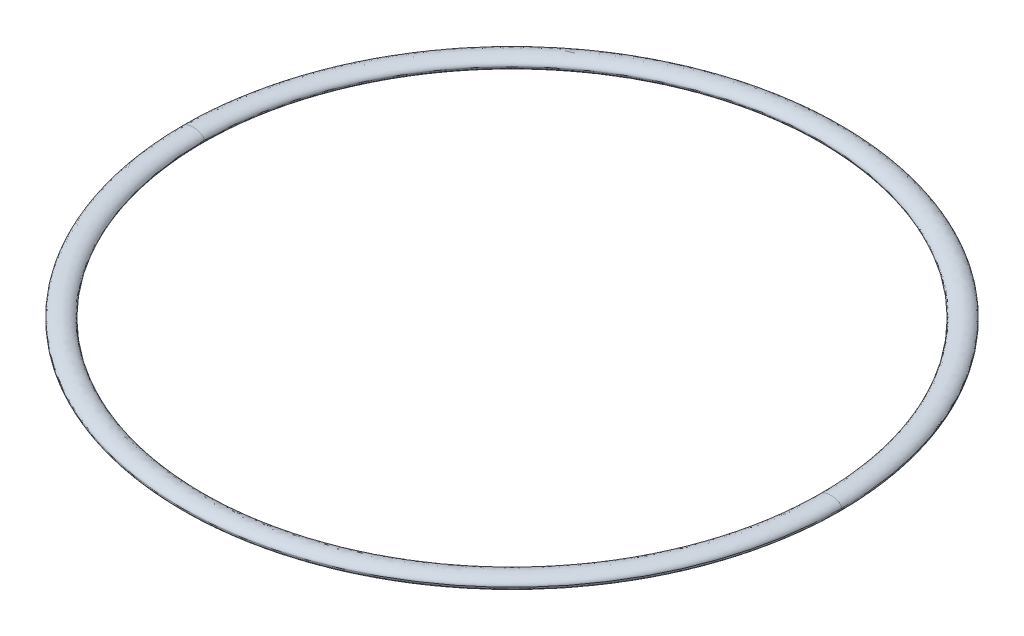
ISO-10303-21;
HEADER;
FILE_DESCRIPTION(('STEP AP214'),'2;1');
FILE_NAME('part.step','',(''),(''),'','','');
FILE_SCHEMA(('AUTOMOTIVE_DESIGN { 1 0 10303 214 1 1 1 1 }'));
ENDSEC;
DATA;
#1=APPLICATION_CONTEXT('core data for automotive mechanical design processes');
#2=APPLICATION_PROTOCOL_DEFINITION('international standard','automotive_design',2000,#1);
#3=PRODUCT_CONTEXT('',#1,'mechanical');
#4=PRODUCT('Part','Part','',(#3));
#5=PRODUCT_RELATED_PRODUCT_CATEGORY('part','',(#4));
#6=PRODUCT_DEFINITION_FORMATION('','',#4);
#7=PRODUCT_DEFINITION_CONTEXT('part definition',#1,'design');
#8=PRODUCT_DEFINITION('design','',#6,#7);
#9=PRODUCT_DEFINITION_SHAPE('','',#8);
#10=(LENGTH_UNIT() NAMED_UNIT(*) SI_UNIT(.MILLI.,.METRE.));
#11=(NAMED_UNIT(*) PLANE_ANGLE_UNIT() SI_UNIT($,.RADIAN.));
#12=(NAMED_UNIT(*) SI_UNIT($,.STERADIAN.) SOLID_ANGLE_UNIT());
#13=UNCERTAINTY_MEASURE_WITH_UNIT(LENGTH_MEASURE(1.E-05),#10,'distance_accuracy_value','');
#14=(GEOMETRIC_REPRESENTATION_CONTEXT(3) GLOBAL_UNCERTAINTY_ASSIGNED_CONTEXT((#13)) GLOBAL_UNIT_ASSIGNED_CONTEXT((#10,
#11,#12)) REPRESENTATION_CONTEXT('',''));
#15=CARTESIAN_POINT('',(0.,0.,0.));
#16=DIRECTION('',(0.,0.,1.));
#17=DIRECTION('',(1.,0.,0.));
#18=AXIS2_PLACEMENT_3D('',#15,#16,#17);
#19=CARTESIAN_POINT('',(38.060558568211,-12.725,0.));
#20=CARTESIAN_POINT('',(38.060558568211,-12.725,76.121117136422));
#21=CARTESIAN_POINT('',(-38.06055856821,-12.725,76.121117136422));
#22=CARTESIAN_POINT('',(-38.06055856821,-12.725,0.));
#23=CARTESIAN_POINT('',(38.060558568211,-14.175,0.));
#24=CARTESIAN_POINT('',(38.060558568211,-14.175,76.121117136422));
#25=CARTESIAN_POINT('',(-38.06055856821,-14.175,76.121117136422));
#26=CARTESIAN_POINT('',(-38.06055856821,-14.175,0.));
#27=CARTESIAN_POINT('',(40.789441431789,-14.175,0.));
#28=CARTESIAN_POINT('',(40.789441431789,-14.175,81.578882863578));
#29=CARTESIAN_POINT('',(-40.78944143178,-14.175,81.578882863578));
#30=CARTESIAN_POINT('',(-40.78944143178,-14.175,0.));
#31=CARTESIAN_POINT('',(40.789441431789,-12.725,0.));
#32=CARTESIAN_POINT('',(40.789441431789,-12.725,81.578882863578));
#33=CARTESIAN_POINT('',(-40.78944143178,-12.725,81.578882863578));
#34=CARTESIAN_POINT('',(-40.78944143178,-12.725,0.));
#35=(BOUNDED_SURFACE() B_SPLINE_SURFACE(3,3,((#19,#20,#21,#22),(#23,#24,#25,#26),(#27,#28,#29,
#30),(#31,#32,#33,#34)),.UNSPECIFIED.,.F.,.F.,.F.) B_SPLINE_SURFACE_WITH_KNOTS((4,4),(4,4),(0.,
1.),(0.,1.),.UNSPECIFIED.) GEOMETRIC_REPRESENTATION_ITEM() RATIONAL_B_SPLINE_SURFACE(((1.,
0.333333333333,0.333333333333,1.),(0.333333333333,0.111111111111,0.111111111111,0.333333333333),
(0.333333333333,0.111111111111,0.111111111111,0.333333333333),(1.,0.333333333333,0.333333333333,1.))) REPRESENTATION_ITEM('') SURFACE());
#36=CARTESIAN_POINT('',(-38.06055856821,-12.725,0.));
#37=CARTESIAN_POINT('',(-38.06055856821,-14.175,0.));
#38=CARTESIAN_POINT('',(-40.78944143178,-14.175,0.));
#39=CARTESIAN_POINT('',(-40.78944143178,-12.725,0.));
#40=(BOUNDED_CURVE() B_SPLINE_CURVE(3,(#36,#37,#38,#39),.UNSPECIFIED.,.F.,
.F.) B_SPLINE_CURVE_WITH_KNOTS((4,4),(3.14159265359,6.28318530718),
.UNSPECIFIED.) CURVE() GEOMETRIC_REPRESENTATION_ITEM() RATIONAL_B_SPLINE_CURVE((1.,
0.333333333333,0.333333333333,1.)) REPRESENTATION_ITEM(''));
#41=CARTESIAN_POINT('',(-38.06055856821,-12.725,0.));
#42=VERTEX_POINT('',#41);
#43=CARTESIAN_POINT('',(-40.78944143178,-12.725,0.));
#44=VERTEX_POINT('',#43);
#45=EDGE_CURVE('E56',#42,#44,#40,.T.);
#46=CARTESIAN_POINT('',(0.,-12.725,0.));
#47=DIRECTION('',(0.,-1.,0.));
#48=DIRECTION('',(1.,0.,0.));
#49=AXIS2_PLACEMENT_3D('',#46,#47,#48);
#50=CIRCLE('',#49,38.060558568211);
#51=CARTESIAN_POINT('',(38.060558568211,-12.725,0.));
#52=VERTEX_POINT('',#51);
#53=EDGE_CURVE('E10',#52,#42,#50,.T.);
#54=CARTESIAN_POINT('',(38.060558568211,-12.725,0.));
#55=CARTESIAN_POINT('',(38.060558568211,-14.175,0.));
#56=CARTESIAN_POINT('',(40.789441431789,-14.175,0.));
#57=CARTESIAN_POINT('',(40.789441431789,-12.725,0.));
#58=(BOUNDED_CURVE() B_SPLINE_CURVE(3,(#54,#55,#56,#57),.UNSPECIFIED.,.F.,
.F.) B_SPLINE_CURVE_WITH_KNOTS((4,4),(3.14159265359,6.28318530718),
.UNSPECIFIED.) CURVE() GEOMETRIC_REPRESENTATION_ITEM() RATIONAL_B_SPLINE_CURVE((1.,
0.333333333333,0.333333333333,1.)) REPRESENTATION_ITEM(''));
#59=CARTESIAN_POINT('',(40.789441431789,-12.725,0.));
#60=VERTEX_POINT('',#59);
#61=EDGE_CURVE('E53',#52,#60,#58,.T.);
#62=CARTESIAN_POINT('',(0.,-12.725,0.));
#63=DIRECTION('',(0.,-1.,0.));
#64=DIRECTION('',(1.,0.,0.));
#65=AXIS2_PLACEMENT_3D('',#62,#63,#64);
#66=CIRCLE('',#65,40.789441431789);
#67=EDGE_CURVE('E28',#60,#44,#66,.T.);
#68=ORIENTED_EDGE('',*,*,#45,.F.);
#69=ORIENTED_EDGE('',*,*,#53,.F.);
#70=ORIENTED_EDGE('',*,*,#61,.T.);
#71=ORIENTED_EDGE('',*,*,#67,.T.);
#72=EDGE_LOOP('',(#68,#69,#70,#71));
#73=FACE_BOUND('',#72,.T.);
#74=ADVANCED_FACE('F16',(#73),#35,.T.);
#75=CARTESIAN_POINT('',(40.789441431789,-12.725,0.));
#76=CARTESIAN_POINT('',(40.789441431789,-12.725,81.578882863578));
#77=CARTESIAN_POINT('',(-40.78944143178,-12.725,81.578882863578));
#78=CARTESIAN_POINT('',(-40.78944143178,-12.725,0.));
#79=CARTESIAN_POINT('',(40.789441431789,-11.275,0.));
#80=CARTESIAN_POINT('',(40.789441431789,-11.275,81.578882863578));
#81=CARTESIAN_POINT('',(-40.78944143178,-11.275,81.578882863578));
#82=CARTESIAN_POINT('',(-40.78944143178,-11.275,0.));
#83=CARTESIAN_POINT('',(38.060558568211,-11.275,0.));
#84=CARTESIAN_POINT('',(38.060558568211,-11.275,76.121117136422));
#85=CARTESIAN_POINT('',(-38.06055856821,-11.275,76.121117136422));
#86=CARTESIAN_POINT('',(-38.06055856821,-11.275,0.));
#87=CARTESIAN_POINT('',(38.060558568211,-12.725,0.));
#88=CARTESIAN_POINT('',(38.060558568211,-12.725,76.121117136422));
#89=CARTESIAN_POINT('',(-38.06055856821,-12.725,76.121117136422));
#90=CARTESIAN_POINT('',(-38.06055856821,-12.725,0.));
#91=(BOUNDED_SURFACE() B_SPLINE_SURFACE(3,3,((#75,#76,#77,#78),(#79,#80,#81,#82),(#83,#84,#85,
#86),(#87,#88,#89,#90)),.UNSPECIFIED.,.F.,.F.,.F.) B_SPLINE_SURFACE_WITH_KNOTS((4,4),(4,4),(0.,
1.),(0.,1.),.UNSPECIFIED.) GEOMETRIC_REPRESENTATION_ITEM() RATIONAL_B_SPLINE_SURFACE(((1.,
0.333333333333,0.333333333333,1.),(0.333333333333,0.111111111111,0.111111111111,0.333333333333),
(0.333333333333,0.111111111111,0.111111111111,0.333333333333),(1.,0.333333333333,0.333333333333,1.))) REPRESENTATION_ITEM('') SURFACE());
#92=CARTESIAN_POINT('',(-40.78944143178,-12.725,0.));
#93=CARTESIAN_POINT('',(-40.78944143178,-11.275,0.));
#94=CARTESIAN_POINT('',(-38.06055856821,-11.275,0.));
#95=CARTESIAN_POINT('',(-38.06055856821,-12.725,0.));
#96=(BOUNDED_CURVE() B_SPLINE_CURVE(3,(#92,#93,#94,#95),.UNSPECIFIED.,.F.,
.F.) B_SPLINE_CURVE_WITH_KNOTS((4,4),(0.,3.14159265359),
.UNSPECIFIED.) CURVE() GEOMETRIC_REPRESENTATION_ITEM() RATIONAL_B_SPLINE_CURVE((1.,
0.333333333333,0.333333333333,1.)) REPRESENTATION_ITEM(''));
#97=EDGE_CURVE('E65',#44,#42,#96,.T.);
#98=CARTESIAN_POINT('',(40.789441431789,-12.725,0.));
#99=CARTESIAN_POINT('',(40.789441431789,-11.275,0.));
#100=CARTESIAN_POINT('',(38.060558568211,-11.275,0.));
#101=CARTESIAN_POINT('',(38.060558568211,-12.725,0.));
#102=(BOUNDED_CURVE() B_SPLINE_CURVE(3,(#98,#99,#100,#101),.UNSPECIFIED.,.F.,
.F.) B_SPLINE_CURVE_WITH_KNOTS((4,4),(0.,3.14159265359),
.UNSPECIFIED.) CURVE() GEOMETRIC_REPRESENTATION_ITEM() RATIONAL_B_SPLINE_CURVE((1.,
0.333333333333,0.333333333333,1.)) REPRESENTATION_ITEM(''));
#103=EDGE_CURVE('E59',#60,#52,#102,.T.);
#104=ORIENTED_EDGE('',*,*,#97,.F.);
#105=ORIENTED_EDGE('',*,*,#67,.F.);
#106=ORIENTED_EDGE('',*,*,#103,.T.);
#107=ORIENTED_EDGE('',*,*,#53,.T.);
#108=EDGE_LOOP('',(#104,#105,#106,#107));
#109=FACE_BOUND('',#108,.T.);
#110=ADVANCED_FACE('F60',(#109),#91,.T.);
#111=CARTESIAN_POINT('',(-40.78944143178,-12.725,0.));
#112=CARTESIAN_POINT('',(-40.78944143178,-12.725,-81.57888286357));
#113=CARTESIAN_POINT('',(40.789441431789,-12.725,-81.57888286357));
#114=CARTESIAN_POINT('',(40.789441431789,-12.725,0.));
#115=CARTESIAN_POINT('',(-40.78944143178,-11.275,0.));
#116=CARTESIAN_POINT('',(-40.78944143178,-11.275,-81.57888286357));
#117=CARTESIAN_POINT('',(40.789441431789,-11.275,-81.57888286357));
#118=CARTESIAN_POINT('',(40.789441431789,-11.275,0.));
#119=CARTESIAN_POINT('',(-38.06055856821,-11.275,0.));
#120=CARTESIAN_POINT('',(-38.06055856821,-11.275,-76.12111713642));
#121=CARTESIAN_POINT('',(38.060558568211,-11.275,-76.12111713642));
#122=CARTESIAN_POINT('',(38.060558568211,-11.275,0.));
#123=CARTESIAN_POINT('',(-38.06055856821,-12.725,0.));
#124=CARTESIAN_POINT('',(-38.06055856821,-12.725,-76.1211171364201));
#125=CARTESIAN_POINT('',(38.060558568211,-12.725,-76.1211171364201));
#126=CARTESIAN_POINT('',(38.060558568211,-12.725,0.));
#127=(BOUNDED_SURFACE() B_SPLINE_SURFACE(3,3,((#111,#112,#113,#114),(#115,#116,#117,#118),(#119,
#120,#121,#122),(#123,#124,#125,#126)),.UNSPECIFIED.,.F.,.F.,
.F.) B_SPLINE_SURFACE_WITH_KNOTS((4,4),(4,4),(0.,1.),(0.,1.),
.UNSPECIFIED.) GEOMETRIC_REPRESENTATION_ITEM() RATIONAL_B_SPLINE_SURFACE(((1.,0.333333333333,
0.333333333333,1.),(0.333333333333,0.111111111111,0.111111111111,0.333333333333),
(0.333333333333,0.111111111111,0.111111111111,0.333333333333),(1.,0.333333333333,0.333333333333,1.))) REPRESENTATION_ITEM('') SURFACE());
#128=CARTESIAN_POINT('',(0.,-12.725,0.));
#129=DIRECTION('',(0.,-1.,0.));
#130=DIRECTION('',(1.,0.,0.));
#131=AXIS2_PLACEMENT_3D('',#128,#129,#130);
#132=CIRCLE('',#131,40.789441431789);
#133=EDGE_CURVE('E21',#44,#60,#132,.T.);
#134=CARTESIAN_POINT('',(0.,-12.725,0.));
#135=DIRECTION('',(0.,-1.,0.));
#136=DIRECTION('',(1.,0.,0.));
#137=AXIS2_PLACEMENT_3D('',#134,#135,#136);
#138=CIRCLE('',#137,38.060558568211);
#139=EDGE_CURVE('E69',#42,#52,#138,.T.);
#140=ORIENTED_EDGE('',*,*,#133,.F.);
#141=ORIENTED_EDGE('',*,*,#97,.T.);
#142=ORIENTED_EDGE('',*,*,#139,.T.);
#143=ORIENTED_EDGE('',*,*,#103,.F.);
#144=EDGE_LOOP('',(#140,#141,#142,#143));
#145=FACE_BOUND('',#144,.T.);
#146=ADVANCED_FACE('F72',(#145),#127,.T.);
#147=CARTESIAN_POINT('',(-38.06055856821,-12.725,0.));
#148=CARTESIAN_POINT('',(-38.06055856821,-12.725,-76.1211171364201));
#149=CARTESIAN_POINT('',(38.060558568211,-12.725,-76.1211171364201));
#150=CARTESIAN_POINT('',(38.060558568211,-12.725,0.));
#151=CARTESIAN_POINT('',(-38.06055856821,-14.175,0.));
#152=CARTESIAN_POINT('',(-38.06055856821,-14.175,-76.12111713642));
#153=CARTESIAN_POINT('',(38.060558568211,-14.175,-76.12111713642));
#154=CARTESIAN_POINT('',(38.060558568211,-14.175,0.));
#155=CARTESIAN_POINT('',(-40.78944143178,-14.175,0.));
#156=CARTESIAN_POINT('',(-40.78944143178,-14.175,-81.57888286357));
#157=CARTESIAN_POINT('',(40.789441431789,-14.175,-81.57888286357));
#158=CARTESIAN_POINT('',(40.789441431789,-14.175,0.));
#159=CARTESIAN_POINT('',(-40.78944143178,-12.725,0.));
#160=CARTESIAN_POINT('',(-40.78944143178,-12.725,-81.57888286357));
#161=CARTESIAN_POINT('',(40.789441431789,-12.725,-81.57888286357));
#162=CARTESIAN_POINT('',(40.789441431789,-12.725,0.));
#163=(BOUNDED_SURFACE() B_SPLINE_SURFACE(3,3,((#147,#148,#149,#150),(#151,#152,#153,#154),(#155,
#156,#157,#158),(#159,#160,#161,#162)),.UNSPECIFIED.,.F.,.F.,
.F.) B_SPLINE_SURFACE_WITH_KNOTS((4,4),(4,4),(0.,1.),(0.,1.),
.UNSPECIFIED.) GEOMETRIC_REPRESENTATION_ITEM() RATIONAL_B_SPLINE_SURFACE(((1.,0.333333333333,
0.333333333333,1.),(0.333333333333,0.111111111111,0.111111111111,0.333333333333),
(0.333333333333,0.111111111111,0.111111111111,0.333333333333),(1.,0.333333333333,0.333333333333,1.))) REPRESENTATION_ITEM('') SURFACE());
#164=ORIENTED_EDGE('',*,*,#139,.F.);
#165=ORIENTED_EDGE('',*,*,#45,.T.);
#166=ORIENTED_EDGE('',*,*,#133,.T.);
#167=ORIENTED_EDGE('',*,*,#61,.F.);
#168=EDGE_LOOP('',(#164,#165,#166,#167));
#169=FACE_BOUND('',#168,.T.);
#170=ADVANCED_FACE('F68',(#169),#163,.T.);
#171=CLOSED_SHELL('',(#74,#110,#146,#170));
#172=MANIFOLD_SOLID_BREP('B1',#171);
#173=ADVANCED_BREP_SHAPE_REPRESENTATION('',(#18,#172),#14);
#174=SHAPE_DEFINITION_REPRESENTATION(#9,#173);
ENDSEC;
END-ISO-10303-21;
